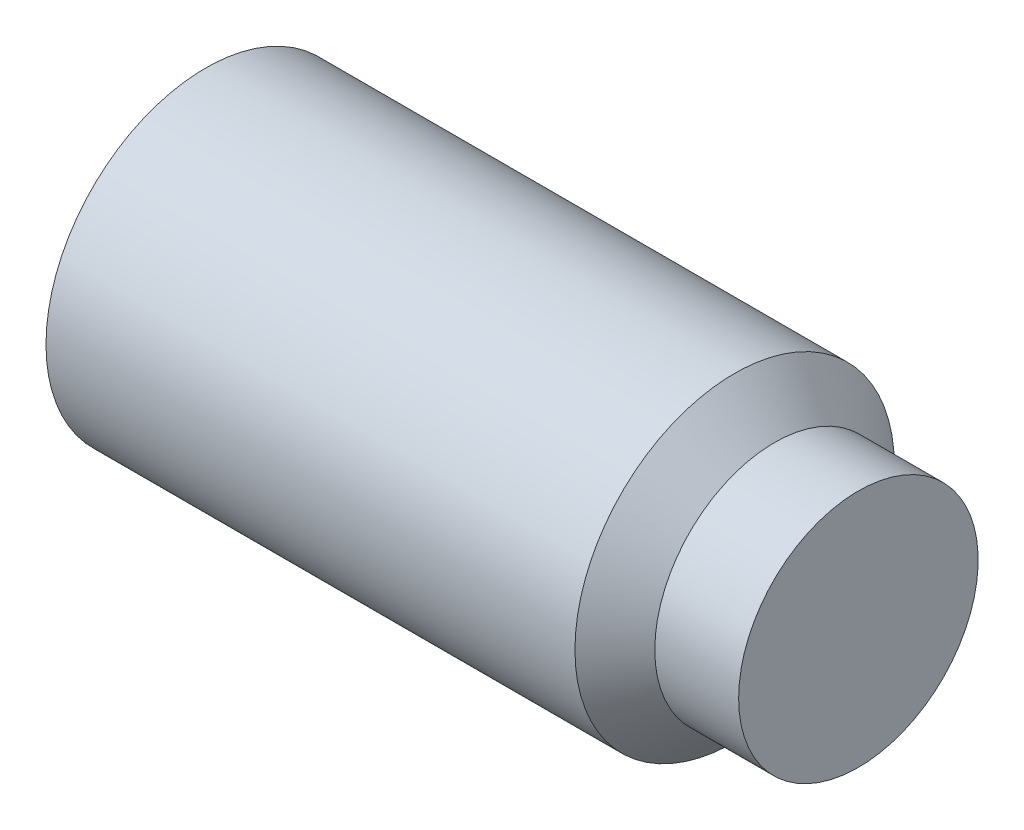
ISO-10303-21;
HEADER;
FILE_DESCRIPTION(('STEP AP214'),'2;1');
FILE_NAME('part.step','',(''),(''),'','','');
FILE_SCHEMA(('AUTOMOTIVE_DESIGN { 1 0 10303 214 1 1 1 1 }'));
ENDSEC;
DATA;
#1=APPLICATION_CONTEXT('core data for automotive mechanical design processes');
#2=APPLICATION_PROTOCOL_DEFINITION('international standard','automotive_design',2000,#1);
#3=PRODUCT_CONTEXT('',#1,'mechanical');
#4=PRODUCT('Part','Part','',(#3));
#5=PRODUCT_RELATED_PRODUCT_CATEGORY('part','',(#4));
#6=PRODUCT_DEFINITION_FORMATION('','',#4);
#7=PRODUCT_DEFINITION_CONTEXT('part definition',#1,'design');
#8=PRODUCT_DEFINITION('design','',#6,#7);
#9=PRODUCT_DEFINITION_SHAPE('','',#8);
#10=(LENGTH_UNIT() NAMED_UNIT(*) SI_UNIT(.MILLI.,.METRE.));
#11=(NAMED_UNIT(*) PLANE_ANGLE_UNIT() SI_UNIT($,.RADIAN.));
#12=(NAMED_UNIT(*) SI_UNIT($,.STERADIAN.) SOLID_ANGLE_UNIT());
#13=UNCERTAINTY_MEASURE_WITH_UNIT(LENGTH_MEASURE(1.E-05),#10,'distance_accuracy_value','');
#14=(GEOMETRIC_REPRESENTATION_CONTEXT(3) GLOBAL_UNCERTAINTY_ASSIGNED_CONTEXT((#13)) GLOBAL_UNIT_ASSIGNED_CONTEXT((#10,
#11,#12)) REPRESENTATION_CONTEXT('',''));
#15=CARTESIAN_POINT('',(0.,0.,0.));
#16=DIRECTION('',(0.,0.,1.));
#17=DIRECTION('',(1.,0.,0.));
#18=AXIS2_PLACEMENT_3D('',#15,#16,#17);
#19=CARTESIAN_POINT('',(0.,0.,0.));
#20=DIRECTION('',(-1.,0.,0.));
#21=DIRECTION('',(0.,0.,1.));
#22=AXIS2_PLACEMENT_3D('',#19,#20,#21);
#23=PLANE('',#22);
#24=CARTESIAN_POINT('',(0.,0.,0.));
#25=DIRECTION('',(-1.,0.,0.));
#26=DIRECTION('',(0.,0.,1.));
#27=AXIS2_PLACEMENT_3D('',#24,#25,#26);
#28=CIRCLE('',#27,10.352);
#29=CARTESIAN_POINT('',(0.,0.,10.352));
#30=VERTEX_POINT('',#29);
#31=EDGE_CURVE('E11',#30,#30,#28,.T.);
#32=ORIENTED_EDGE('',*,*,#31,.T.);
#33=EDGE_LOOP('',(#32));
#34=FACE_BOUND('',#33,.T.);
#35=DIRECTION('',(0.,0.,-1.));
#36=VECTOR('',#35,1.);
#37=CARTESIAN_POINT('',(0.,6.,3.46410161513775));
#38=LINE('',#37,#36);
#39=CARTESIAN_POINT('',(0.,6.,3.46410161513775));
#40=VERTEX_POINT('',#39);
#41=CARTESIAN_POINT('',(0.,6.,-3.46410161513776));
#42=VERTEX_POINT('',#41);
#43=EDGE_CURVE('E127',#40,#42,#38,.T.);
#44=ORIENTED_EDGE('',*,*,#43,.F.);
#45=DIRECTION('',(0.,-0.866025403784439,0.5));
#46=VECTOR('',#45,1.);
#47=CARTESIAN_POINT('',(0.,6.,3.46410161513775));
#48=LINE('',#47,#46);
#49=CARTESIAN_POINT('',(0.,0.,6.9282032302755));
#50=VERTEX_POINT('',#49);
#51=EDGE_CURVE('E49',#40,#50,#48,.T.);
#52=ORIENTED_EDGE('',*,*,#51,.T.);
#53=DIRECTION('',(0.,0.866025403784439,0.5));
#54=VECTOR('',#53,1.);
#55=CARTESIAN_POINT('',(0.,-5.99999999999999,3.46410161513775));
#56=LINE('',#55,#54);
#57=CARTESIAN_POINT('',(0.,-5.99999999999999,3.46410161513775));
#58=VERTEX_POINT('',#57);
#59=EDGE_CURVE('E118',#58,#50,#56,.T.);
#60=ORIENTED_EDGE('',*,*,#59,.F.);
#61=DIRECTION('',(0.,0.,-1.));
#62=VECTOR('',#61,1.);
#63=CARTESIAN_POINT('',(0.,-5.99999999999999,3.46410161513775));
#64=LINE('',#63,#62);
#65=CARTESIAN_POINT('',(0.,-5.99999999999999,-3.46410161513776));
#66=VERTEX_POINT('',#65);
#67=EDGE_CURVE('E121',#58,#66,#64,.T.);
#68=ORIENTED_EDGE('',*,*,#67,.T.);
#69=DIRECTION('',(0.,0.866025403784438,-0.5));
#70=VECTOR('',#69,1.);
#71=CARTESIAN_POINT('',(0.,-5.99999999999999,-3.46410161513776));
#72=LINE('',#71,#70);
#73=CARTESIAN_POINT('',(0.,0.,-6.92820323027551));
#74=VERTEX_POINT('',#73);
#75=EDGE_CURVE('E124',#66,#74,#72,.T.);
#76=ORIENTED_EDGE('',*,*,#75,.T.);
#77=DIRECTION('',(0.,-0.866025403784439,-0.5));
#78=VECTOR('',#77,1.);
#79=CARTESIAN_POINT('',(0.,6.,-3.46410161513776));
#80=LINE('',#79,#78);
#81=EDGE_CURVE('E107',#42,#74,#80,.T.);
#82=ORIENTED_EDGE('',*,*,#81,.F.);
#83=EDGE_LOOP('',(#44,#52,#60,#68,#76,#82));
#84=FACE_BOUND('',#83,.T.);
#85=ADVANCED_FACE('F35',(#34,#84),#23,.T.);
#86=CARTESIAN_POINT('',(0.,0.,0.));
#87=DIRECTION('',(1.,0.,0.));
#88=DIRECTION('',(0.,0.,-1.));
#89=AXIS2_PLACEMENT_3D('',#86,#87,#88);
#90=CONICAL_SURFACE('',#89,10.352,1.04719755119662);
#91=CARTESIAN_POINT('',(0.951473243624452,0.,0.));
#92=DIRECTION('',(-1.,0.,0.));
#93=DIRECTION('',(0.,0.,1.));
#94=AXIS2_PLACEMENT_3D('',#91,#92,#93);
#95=CIRCLE('',#94,12.);
#96=CARTESIAN_POINT('',(0.951473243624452,0.,12.));
#97=VERTEX_POINT('',#96);
#98=EDGE_CURVE('E42',#97,#97,#95,.T.);
#99=ORIENTED_EDGE('',*,*,#98,.T.);
#100=EDGE_LOOP('',(#99));
#101=FACE_BOUND('',#100,.T.);
#102=ORIENTED_EDGE('',*,*,#31,.F.);
#103=EDGE_LOOP('',(#102));
#104=FACE_BOUND('',#103,.T.);
#105=ADVANCED_FACE('F147',(#101,#104),#90,.T.);
#106=CARTESIAN_POINT('',(-12.7,0.,0.));
#107=DIRECTION('',(-1.,0.,0.));
#108=DIRECTION('',(0.,0.,1.));
#109=AXIS2_PLACEMENT_3D('',#106,#107,#108);
#110=CYLINDRICAL_SURFACE('',#109,12.);
#111=CARTESIAN_POINT('',(40.7,0.,0.));
#112=DIRECTION('',(-1.,0.,0.));
#113=DIRECTION('',(0.,0.,1.));
#114=AXIS2_PLACEMENT_3D('',#111,#112,#113);
#115=CIRCLE('',#114,12.);
#116=CARTESIAN_POINT('',(40.7,0.,12.));
#117=VERTEX_POINT('',#116);
#118=EDGE_CURVE('E142',#117,#117,#115,.T.);
#119=ORIENTED_EDGE('',*,*,#118,.T.);
#120=EDGE_LOOP('',(#119));
#121=FACE_BOUND('',#120,.T.);
#122=ORIENTED_EDGE('',*,*,#98,.F.);
#123=EDGE_LOOP('',(#122));
#124=FACE_BOUND('',#123,.T.);
#125=ADVANCED_FACE('F150',(#121,#124),#110,.T.);
#126=CARTESIAN_POINT('',(40.7,0.,0.));
#127=DIRECTION('',(-1.,0.,0.));
#128=DIRECTION('',(0.,0.,1.));
#129=AXIS2_PLACEMENT_3D('',#126,#127,#128);
#130=CONICAL_SURFACE('',#129,12.,0.785398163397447);
#131=CARTESIAN_POINT('',(43.7,0.,0.));
#132=DIRECTION('',(-1.,0.,0.));
#133=DIRECTION('',(0.,0.,1.));
#134=AXIS2_PLACEMENT_3D('',#131,#132,#133);
#135=CIRCLE('',#134,9.);
#136=CARTESIAN_POINT('',(43.7,0.,9.));
#137=VERTEX_POINT('',#136);
#138=EDGE_CURVE('E139',#137,#137,#135,.T.);
#139=ORIENTED_EDGE('',*,*,#138,.T.);
#140=EDGE_LOOP('',(#139));
#141=FACE_BOUND('',#140,.T.);
#142=ORIENTED_EDGE('',*,*,#118,.F.);
#143=EDGE_LOOP('',(#142));
#144=FACE_BOUND('',#143,.T.);
#145=ADVANCED_FACE('F152',(#141,#144),#130,.T.);
#146=CARTESIAN_POINT('',(-12.7,0.,0.));
#147=DIRECTION('',(-1.,0.,0.));
#148=DIRECTION('',(0.,0.,1.));
#149=AXIS2_PLACEMENT_3D('',#146,#147,#148);
#150=CYLINDRICAL_SURFACE('',#149,9.);
#151=CARTESIAN_POINT('',(50.,0.,0.));
#152=DIRECTION('',(-1.,0.,0.));
#153=DIRECTION('',(0.,0.,1.));
#154=AXIS2_PLACEMENT_3D('',#151,#152,#153);
#155=CIRCLE('',#154,9.);
#156=CARTESIAN_POINT('',(50.,0.,9.));
#157=VERTEX_POINT('',#156);
#158=EDGE_CURVE('E136',#157,#157,#155,.T.);
#159=ORIENTED_EDGE('',*,*,#158,.T.);
#160=EDGE_LOOP('',(#159));
#161=FACE_BOUND('',#160,.T.);
#162=ORIENTED_EDGE('',*,*,#138,.F.);
#163=EDGE_LOOP('',(#162));
#164=FACE_BOUND('',#163,.T.);
#165=ADVANCED_FACE('F159',(#161,#164),#150,.T.);
#166=CARTESIAN_POINT('',(50.,9.,0.));
#167=DIRECTION('',(1.,0.,0.));
#168=DIRECTION('',(0.,0.,-1.));
#169=AXIS2_PLACEMENT_3D('',#166,#167,#168);
#170=PLANE('',#169);
#171=ORIENTED_EDGE('',*,*,#158,.F.);
#172=EDGE_LOOP('',(#171));
#173=FACE_BOUND('',#172,.T.);
#174=ADVANCED_FACE('F194',(#173),#170,.T.);
#175=CARTESIAN_POINT('',(15.,6.,3.46410161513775));
#176=DIRECTION('',(0.,-0.5,-0.866025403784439));
#177=DIRECTION('',(0.,0.866025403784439,-0.5));
#178=AXIS2_PLACEMENT_3D('',#175,#176,#177);
#179=PLANE('',#178);
#180=ORIENTED_EDGE('',*,*,#51,.F.);
#181=DIRECTION('',(-1.,0.,0.));
#182=VECTOR('',#181,1.);
#183=CARTESIAN_POINT('',(15.,6.,3.46410161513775));
#184=LINE('',#183,#182);
#185=CARTESIAN_POINT('',(15.,6.,3.46410161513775));
#186=VERTEX_POINT('',#185);
#187=EDGE_CURVE('E54',#186,#40,#184,.T.);
#188=ORIENTED_EDGE('',*,*,#187,.F.);
#189=DIRECTION('',(0.,-0.866025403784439,0.5));
#190=VECTOR('',#189,1.);
#191=CARTESIAN_POINT('',(15.,6.,3.46410161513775));
#192=LINE('',#191,#190);
#193=CARTESIAN_POINT('',(15.,0.,6.9282032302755));
#194=VERTEX_POINT('',#193);
#195=EDGE_CURVE('E81',#186,#194,#192,.T.);
#196=ORIENTED_EDGE('',*,*,#195,.T.);
#197=DIRECTION('',(-1.,0.,0.));
#198=VECTOR('',#197,1.);
#199=CARTESIAN_POINT('',(15.,0.,6.9282032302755));
#200=LINE('',#199,#198);
#201=EDGE_CURVE('E134',#194,#50,#200,.T.);
#202=ORIENTED_EDGE('',*,*,#201,.T.);
#203=EDGE_LOOP('',(#180,#188,#196,#202));
#204=FACE_BOUND('',#203,.T.);
#205=ADVANCED_FACE('F190',(#204),#179,.T.);
#206=CARTESIAN_POINT('',(15.,-5.99999999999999,3.46410161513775));
#207=DIRECTION('',(0.,-0.5,0.866025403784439));
#208=DIRECTION('',(0.,-0.866025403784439,-0.5));
#209=AXIS2_PLACEMENT_3D('',#206,#207,#208);
#210=PLANE('',#209);
#211=ORIENTED_EDGE('',*,*,#59,.T.);
#212=ORIENTED_EDGE('',*,*,#201,.F.);
#213=DIRECTION('',(0.,0.866025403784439,0.5));
#214=VECTOR('',#213,1.);
#215=CARTESIAN_POINT('',(15.,-5.99999999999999,3.46410161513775));
#216=LINE('',#215,#214);
#217=CARTESIAN_POINT('',(15.,-5.99999999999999,3.46410161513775));
#218=VERTEX_POINT('',#217);
#219=EDGE_CURVE('E284',#218,#194,#216,.T.);
#220=ORIENTED_EDGE('',*,*,#219,.F.);
#221=DIRECTION('',(-1.,0.,0.));
#222=VECTOR('',#221,1.);
#223=CARTESIAN_POINT('',(15.,-5.99999999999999,3.46410161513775));
#224=LINE('',#223,#222);
#225=EDGE_CURVE('E132',#218,#58,#224,.T.);
#226=ORIENTED_EDGE('',*,*,#225,.T.);
#227=EDGE_LOOP('',(#211,#212,#220,#226));
#228=FACE_BOUND('',#227,.T.);
#229=ADVANCED_FACE('F186',(#228),#210,.F.);
#230=CARTESIAN_POINT('',(15.,-5.99999999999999,3.46410161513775));
#231=DIRECTION('',(0.,1.,0.));
#232=DIRECTION('',(0.,0.,1.));
#233=AXIS2_PLACEMENT_3D('',#230,#231,#232);
#234=PLANE('',#233);
#235=ORIENTED_EDGE('',*,*,#67,.F.);
#236=ORIENTED_EDGE('',*,*,#225,.F.);
#237=DIRECTION('',(0.,0.,-1.));
#238=VECTOR('',#237,1.);
#239=CARTESIAN_POINT('',(15.,-5.99999999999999,3.46410161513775));
#240=LINE('',#239,#238);
#241=CARTESIAN_POINT('',(15.,-5.99999999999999,-3.46410161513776));
#242=VERTEX_POINT('',#241);
#243=EDGE_CURVE('E102',#218,#242,#240,.T.);
#244=ORIENTED_EDGE('',*,*,#243,.T.);
#245=DIRECTION('',(-1.,0.,0.));
#246=VECTOR('',#245,1.);
#247=CARTESIAN_POINT('',(15.,-5.99999999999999,-3.46410161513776));
#248=LINE('',#247,#246);
#249=EDGE_CURVE('E97',#242,#66,#248,.T.);
#250=ORIENTED_EDGE('',*,*,#249,.T.);
#251=EDGE_LOOP('',(#235,#236,#244,#250));
#252=FACE_BOUND('',#251,.T.);
#253=ADVANCED_FACE('F183',(#252),#234,.T.);
#254=CARTESIAN_POINT('',(15.,-5.99999999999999,-3.46410161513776));
#255=DIRECTION('',(0.,0.5,0.866025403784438));
#256=DIRECTION('',(0.,-0.866025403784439,0.5));
#257=AXIS2_PLACEMENT_3D('',#254,#255,#256);
#258=PLANE('',#257);
#259=ORIENTED_EDGE('',*,*,#75,.F.);
#260=ORIENTED_EDGE('',*,*,#249,.F.);
#261=DIRECTION('',(0.,0.866025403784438,-0.5));
#262=VECTOR('',#261,1.);
#263=CARTESIAN_POINT('',(15.,-5.99999999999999,-3.46410161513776));
#264=LINE('',#263,#262);
#265=CARTESIAN_POINT('',(15.,0.,-6.92820323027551));
#266=VERTEX_POINT('',#265);
#267=EDGE_CURVE('E92',#242,#266,#264,.T.);
#268=ORIENTED_EDGE('',*,*,#267,.T.);
#269=DIRECTION('',(-1.,0.,0.));
#270=VECTOR('',#269,1.);
#271=CARTESIAN_POINT('',(15.,0.,-6.92820323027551));
#272=LINE('',#271,#270);
#273=EDGE_CURVE('E96',#266,#74,#272,.T.);
#274=ORIENTED_EDGE('',*,*,#273,.T.);
#275=EDGE_LOOP('',(#259,#260,#268,#274));
#276=FACE_BOUND('',#275,.T.);
#277=ADVANCED_FACE('F95',(#276),#258,.T.);
#278=CARTESIAN_POINT('',(15.,6.,-3.46410161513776));
#279=DIRECTION('',(0.,0.5,-0.866025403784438));
#280=DIRECTION('',(0.,0.866025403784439,0.5));
#281=AXIS2_PLACEMENT_3D('',#278,#279,#280);
#282=PLANE('',#281);
#283=ORIENTED_EDGE('',*,*,#81,.T.);
#284=ORIENTED_EDGE('',*,*,#273,.F.);
#285=DIRECTION('',(0.,-0.866025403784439,-0.5));
#286=VECTOR('',#285,1.);
#287=CARTESIAN_POINT('',(15.,6.,-3.46410161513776));
#288=LINE('',#287,#286);
#289=CARTESIAN_POINT('',(15.,6.,-3.46410161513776));
#290=VERTEX_POINT('',#289);
#291=EDGE_CURVE('E101',#290,#266,#288,.T.);
#292=ORIENTED_EDGE('',*,*,#291,.F.);
#293=DIRECTION('',(-1.,0.,0.));
#294=VECTOR('',#293,1.);
#295=CARTESIAN_POINT('',(15.,6.,-3.46410161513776));
#296=LINE('',#295,#294);
#297=EDGE_CURVE('E77',#290,#42,#296,.T.);
#298=ORIENTED_EDGE('',*,*,#297,.T.);
#299=EDGE_LOOP('',(#283,#284,#292,#298));
#300=FACE_BOUND('',#299,.T.);
#301=ADVANCED_FACE('F104',(#300),#282,.F.);
#302=CARTESIAN_POINT('',(15.,6.,3.46410161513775));
#303=DIRECTION('',(0.,1.,0.));
#304=DIRECTION('',(0.,0.,1.));
#305=AXIS2_PLACEMENT_3D('',#302,#303,#304);
#306=PLANE('',#305);
#307=ORIENTED_EDGE('',*,*,#43,.T.);
#308=ORIENTED_EDGE('',*,*,#297,.F.);
#309=DIRECTION('',(0.,0.,-1.));
#310=VECTOR('',#309,1.);
#311=CARTESIAN_POINT('',(15.,6.,3.46410161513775));
#312=LINE('',#311,#310);
#313=EDGE_CURVE('E112',#186,#290,#312,.T.);
#314=ORIENTED_EDGE('',*,*,#313,.F.);
#315=ORIENTED_EDGE('',*,*,#187,.T.);
#316=EDGE_LOOP('',(#307,#308,#314,#315));
#317=FACE_BOUND('',#316,.T.);
#318=ADVANCED_FACE('F171',(#317),#306,.F.);
#319=CARTESIAN_POINT('',(15.,6.,3.46410161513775));
#320=DIRECTION('',(1.,0.,0.));
#321=DIRECTION('',(0.,0.,-1.));
#322=AXIS2_PLACEMENT_3D('',#319,#320,#321);
#323=PLANE('',#322);
#324=ORIENTED_EDGE('',*,*,#195,.F.);
#325=ORIENTED_EDGE('',*,*,#313,.T.);
#326=ORIENTED_EDGE('',*,*,#291,.T.);
#327=ORIENTED_EDGE('',*,*,#267,.F.);
#328=ORIENTED_EDGE('',*,*,#243,.F.);
#329=ORIENTED_EDGE('',*,*,#219,.T.);
#330=EDGE_LOOP('',(#324,#325,#326,#327,#328,#329));
#331=FACE_BOUND('',#330,.T.);
#332=ADVANCED_FACE('F110',(#331),#323,.F.);
#333=CLOSED_SHELL('',(#85,#105,#125,#145,#165,#174,#205,#229,#253,#277,#301,#318,#332));
#334=MANIFOLD_SOLID_BREP('B2',#333);
#335=ADVANCED_BREP_SHAPE_REPRESENTATION('',(#18,#334),#14);
#336=SHAPE_DEFINITION_REPRESENTATION(#9,#335);
ENDSEC;
END-ISO-10303-21;
